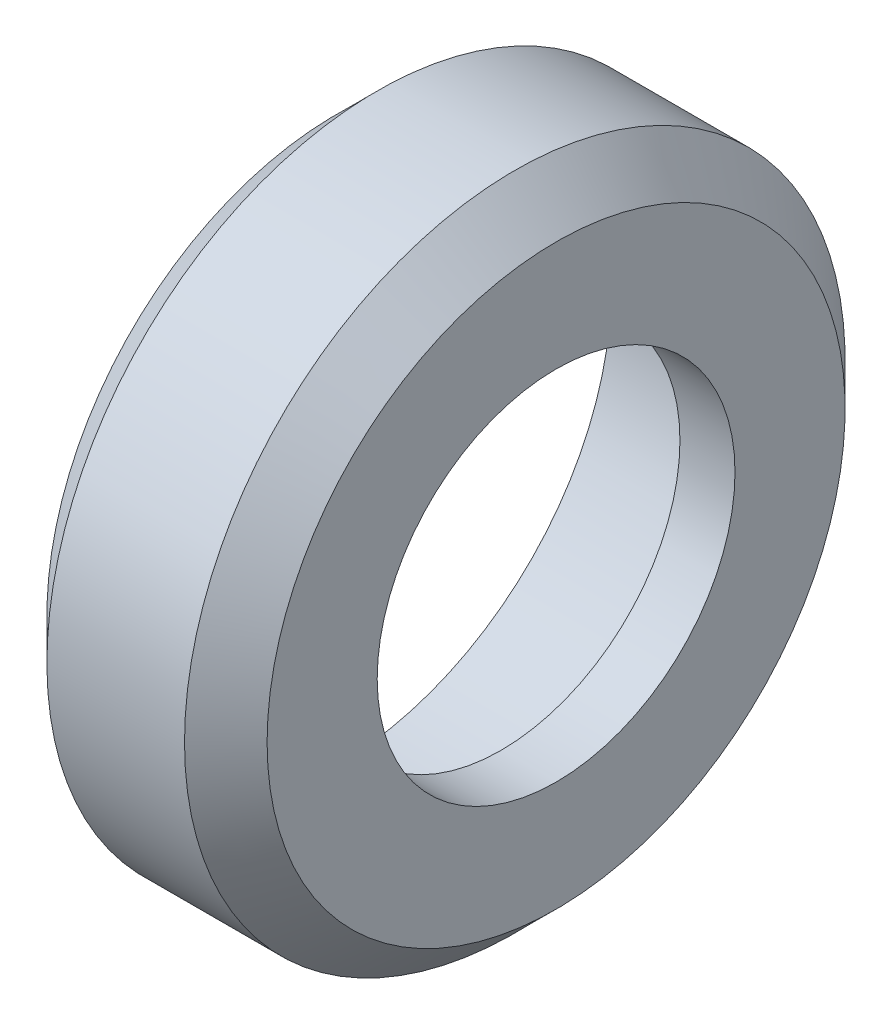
ISO-10303-21;
HEADER;
FILE_DESCRIPTION(('STEP AP214'),'2;1');
FILE_NAME('part.step','',(''),(''),'','','');
FILE_SCHEMA(('AUTOMOTIVE_DESIGN { 1 0 10303 214 1 1 1 1 }'));
ENDSEC;
DATA;
#1=APPLICATION_CONTEXT('core data for automotive mechanical design processes');
#2=APPLICATION_PROTOCOL_DEFINITION('international standard','automotive_design',2000,#1);
#3=PRODUCT_CONTEXT('',#1,'mechanical');
#4=PRODUCT('Part','Part','',(#3));
#5=PRODUCT_RELATED_PRODUCT_CATEGORY('part','',(#4));
#6=PRODUCT_DEFINITION_FORMATION('','',#4);
#7=PRODUCT_DEFINITION_CONTEXT('part definition',#1,'design');
#8=PRODUCT_DEFINITION('design','',#6,#7);
#9=PRODUCT_DEFINITION_SHAPE('','',#8);
#10=(LENGTH_UNIT() NAMED_UNIT(*) SI_UNIT(.MILLI.,.METRE.));
#11=(NAMED_UNIT(*) PLANE_ANGLE_UNIT() SI_UNIT($,.RADIAN.));
#12=(NAMED_UNIT(*) SI_UNIT($,.STERADIAN.) SOLID_ANGLE_UNIT());
#13=UNCERTAINTY_MEASURE_WITH_UNIT(LENGTH_MEASURE(1.E-05),#10,'distance_accuracy_value','');
#14=(GEOMETRIC_REPRESENTATION_CONTEXT(3) GLOBAL_UNCERTAINTY_ASSIGNED_CONTEXT((#13)) GLOBAL_UNIT_ASSIGNED_CONTEXT((#10,
#11,#12)) REPRESENTATION_CONTEXT('',''));
#15=CARTESIAN_POINT('',(0.,0.,0.));
#16=DIRECTION('',(0.,0.,1.));
#17=DIRECTION('',(1.,0.,0.));
#18=AXIS2_PLACEMENT_3D('',#15,#16,#17);
#19=CARTESIAN_POINT('',(4.,-4.645866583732,-29.332847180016));
#20=DIRECTION('',(1.,0.,0.));
#21=DIRECTION('',(0.,0.809016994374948,0.587785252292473));
#22=AXIS2_PLACEMENT_3D('',#19,#20,#21);
#23=PLANE('',#22);
#24=CARTESIAN_POINT('',(4.,0.,0.));
#25=DIRECTION('',(-1.,0.,0.));
#26=DIRECTION('',(0.,0.,1.));
#27=AXIS2_PLACEMENT_3D('',#24,#25,#26);
#28=CIRCLE('',#27,12.9999999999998);
#29=CARTESIAN_POINT('',(4.,0.,12.9999999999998));
#30=VERTEX_POINT('',#29);
#31=EDGE_CURVE('E54',#30,#30,#28,.F.);
#32=ORIENTED_EDGE('',*,*,#31,.F.);
#33=EDGE_LOOP('',(#32));
#34=FACE_BOUND('',#33,.T.);
#35=CARTESIAN_POINT('',(4.,0.,0.));
#36=DIRECTION('',(-1.,0.,0.));
#37=DIRECTION('',(0.,0.,1.));
#38=AXIS2_PLACEMENT_3D('',#35,#36,#37);
#39=CIRCLE('',#38,21.0000000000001);
#40=CARTESIAN_POINT('',(4.,0.,21.0000000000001));
#41=VERTEX_POINT('',#40);
#42=EDGE_CURVE('E58',#41,#41,#39,.F.);
#43=ORIENTED_EDGE('',*,*,#42,.T.);
#44=EDGE_LOOP('',(#43));
#45=FACE_BOUND('',#44,.T.);
#46=ADVANCED_FACE('F14',(#34,#45),#23,.T.);
#47=CARTESIAN_POINT('',(4.,0.,0.));
#48=DIRECTION('',(-1.,0.,0.));
#49=DIRECTION('',(0.,0.,1.));
#50=AXIS2_PLACEMENT_3D('',#47,#48,#49);
#51=CONICAL_SURFACE('',#50,21.0000000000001,0.785398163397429);
#52=ORIENTED_EDGE('',*,*,#42,.F.);
#53=EDGE_LOOP('',(#52));
#54=FACE_BOUND('',#53,.T.);
#55=CARTESIAN_POINT('',(1.,0.,0.));
#56=DIRECTION('',(-1.,0.,0.));
#57=DIRECTION('',(0.,0.809016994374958,0.587785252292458));
#58=AXIS2_PLACEMENT_3D('',#55,#56,#57);
#59=CIRCLE('',#58,24.);
#60=CARTESIAN_POINT('',(1.,19.416407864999,14.106846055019));
#61=VERTEX_POINT('',#60);
#62=EDGE_CURVE('E51',#61,#61,#59,.F.);
#63=ORIENTED_EDGE('',*,*,#62,.T.);
#64=EDGE_LOOP('',(#63));
#65=FACE_BOUND('',#64,.T.);
#66=ADVANCED_FACE('F65',(#54,#65),#51,.T.);
#67=CARTESIAN_POINT('',(4.,0.,0.));
#68=DIRECTION('',(-1.,0.,0.));
#69=DIRECTION('',(0.,0.,1.));
#70=AXIS2_PLACEMENT_3D('',#67,#68,#69);
#71=CYLINDRICAL_SURFACE('',#70,12.9999999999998);
#72=CARTESIAN_POINT('',(0.,0.,0.));
#73=DIRECTION('',(-1.,0.,0.));
#74=DIRECTION('',(0.,0.,1.));
#75=AXIS2_PLACEMENT_3D('',#72,#73,#74);
#76=CIRCLE('',#75,12.9999999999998);
#77=CARTESIAN_POINT('',(0.,0.,12.9999999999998));
#78=VERTEX_POINT('',#77);
#79=EDGE_CURVE('E47',#78,#78,#76,.F.);
#80=ORIENTED_EDGE('',*,*,#79,.F.);
#81=EDGE_LOOP('',(#80));
#82=FACE_BOUND('',#81,.T.);
#83=ORIENTED_EDGE('',*,*,#31,.T.);
#84=EDGE_LOOP('',(#83));
#85=FACE_BOUND('',#84,.T.);
#86=ADVANCED_FACE('F68',(#82,#85),#71,.F.);
#87=CARTESIAN_POINT('',(1.,0.,0.));
#88=DIRECTION('',(-1.,0.,0.));
#89=DIRECTION('',(0.,0.,1.));
#90=AXIS2_PLACEMENT_3D('',#87,#88,#89);
#91=CYLINDRICAL_SURFACE('',#90,24.);
#92=ORIENTED_EDGE('',*,*,#62,.F.);
#93=EDGE_LOOP('',(#92));
#94=FACE_BOUND('',#93,.T.);
#95=CARTESIAN_POINT('',(-9.,0.,0.));
#96=DIRECTION('',(-1.,0.,0.));
#97=DIRECTION('',(0.,0.809016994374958,0.587785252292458));
#98=AXIS2_PLACEMENT_3D('',#95,#96,#97);
#99=CIRCLE('',#98,24.);
#100=CARTESIAN_POINT('',(-9.,19.416407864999,14.106846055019));
#101=VERTEX_POINT('',#100);
#102=EDGE_CURVE('E44',#101,#101,#99,.F.);
#103=ORIENTED_EDGE('',*,*,#102,.T.);
#104=EDGE_LOOP('',(#103));
#105=FACE_BOUND('',#104,.T.);
#106=ADVANCED_FACE('F80',(#94,#105),#91,.T.);
#107=CARTESIAN_POINT('',(0.,-27.936044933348,4.4246348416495));
#108=DIRECTION('',(-1.,0.,0.));
#109=DIRECTION('',(0.,0.809016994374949,0.587785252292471));
#110=AXIS2_PLACEMENT_3D('',#107,#108,#109);
#111=PLANE('',#110);
#112=ORIENTED_EDGE('',*,*,#79,.T.);
#113=EDGE_LOOP('',(#112));
#114=FACE_BOUND('',#113,.T.);
#115=CARTESIAN_POINT('',(0.,0.,0.));
#116=DIRECTION('',(-1.,0.,0.));
#117=DIRECTION('',(0.,0.,1.));
#118=AXIS2_PLACEMENT_3D('',#115,#116,#117);
#119=CIRCLE('',#118,19.9999999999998);
#120=CARTESIAN_POINT('',(0.,0.,19.9999999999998));
#121=VERTEX_POINT('',#120);
#122=EDGE_CURVE('E32',#121,#121,#119,.F.);
#123=ORIENTED_EDGE('',*,*,#122,.F.);
#124=EDGE_LOOP('',(#123));
#125=FACE_BOUND('',#124,.T.);
#126=ADVANCED_FACE('F86',(#114,#125),#111,.T.);
#127=CARTESIAN_POINT('',(-9.,0.,0.));
#128=DIRECTION('',(1.,0.,0.));
#129=DIRECTION('',(0.,0.,-1.));
#130=AXIS2_PLACEMENT_3D('',#127,#128,#129);
#131=CONICAL_SURFACE('',#130,24.,0.785398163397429);
#132=ORIENTED_EDGE('',*,*,#102,.F.);
#133=EDGE_LOOP('',(#132));
#134=FACE_BOUND('',#133,.T.);
#135=CARTESIAN_POINT('',(-12.,0.,0.));
#136=DIRECTION('',(1.,0.,0.));
#137=DIRECTION('',(0.,0.,-1.));
#138=AXIS2_PLACEMENT_3D('',#135,#136,#137);
#139=CIRCLE('',#138,21.0000000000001);
#140=CARTESIAN_POINT('',(-12.,0.,-21.0000000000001));
#141=VERTEX_POINT('',#140);
#142=EDGE_CURVE('E23',#141,#141,#139,.F.);
#143=ORIENTED_EDGE('',*,*,#142,.F.);
#144=EDGE_LOOP('',(#143));
#145=FACE_BOUND('',#144,.T.);
#146=ADVANCED_FACE('F82',(#134,#145),#131,.T.);
#147=CARTESIAN_POINT('',(0.,0.,0.));
#148=DIRECTION('',(-1.,0.,0.));
#149=DIRECTION('',(0.,0.,1.));
#150=AXIS2_PLACEMENT_3D('',#147,#148,#149);
#151=CYLINDRICAL_SURFACE('',#150,19.9999999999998);
#152=CARTESIAN_POINT('',(-12.,0.,0.));
#153=DIRECTION('',(-1.,0.,0.));
#154=DIRECTION('',(0.,0.,1.));
#155=AXIS2_PLACEMENT_3D('',#152,#153,#154);
#156=CIRCLE('',#155,19.9999999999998);
#157=CARTESIAN_POINT('',(-12.,0.,19.9999999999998));
#158=VERTEX_POINT('',#157);
#159=EDGE_CURVE('E10',#158,#158,#156,.F.);
#160=ORIENTED_EDGE('',*,*,#159,.F.);
#161=EDGE_LOOP('',(#160));
#162=FACE_BOUND('',#161,.T.);
#163=ORIENTED_EDGE('',*,*,#122,.T.);
#164=EDGE_LOOP('',(#163));
#165=FACE_BOUND('',#164,.T.);
#166=ADVANCED_FACE('F85',(#162,#165),#151,.F.);
#167=CARTESIAN_POINT('',(-12.,-29.332847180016,4.645866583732));
#168=DIRECTION('',(-1.,0.,0.));
#169=DIRECTION('',(0.,0.809016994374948,0.587785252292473));
#170=AXIS2_PLACEMENT_3D('',#167,#168,#169);
#171=PLANE('',#170);
#172=ORIENTED_EDGE('',*,*,#159,.T.);
#173=EDGE_LOOP('',(#172));
#174=FACE_BOUND('',#173,.T.);
#175=ORIENTED_EDGE('',*,*,#142,.T.);
#176=EDGE_LOOP('',(#175));
#177=FACE_BOUND('',#176,.T.);
#178=ADVANCED_FACE('F16',(#174,#177),#171,.T.);
#179=CLOSED_SHELL('',(#46,#66,#86,#106,#126,#146,#166,#178));
#180=MANIFOLD_SOLID_BREP('B1',#179);
#181=ADVANCED_BREP_SHAPE_REPRESENTATION('',(#18,#180),#14);
#182=SHAPE_DEFINITION_REPRESENTATION(#9,#181);
ENDSEC;
END-ISO-10303-21;
